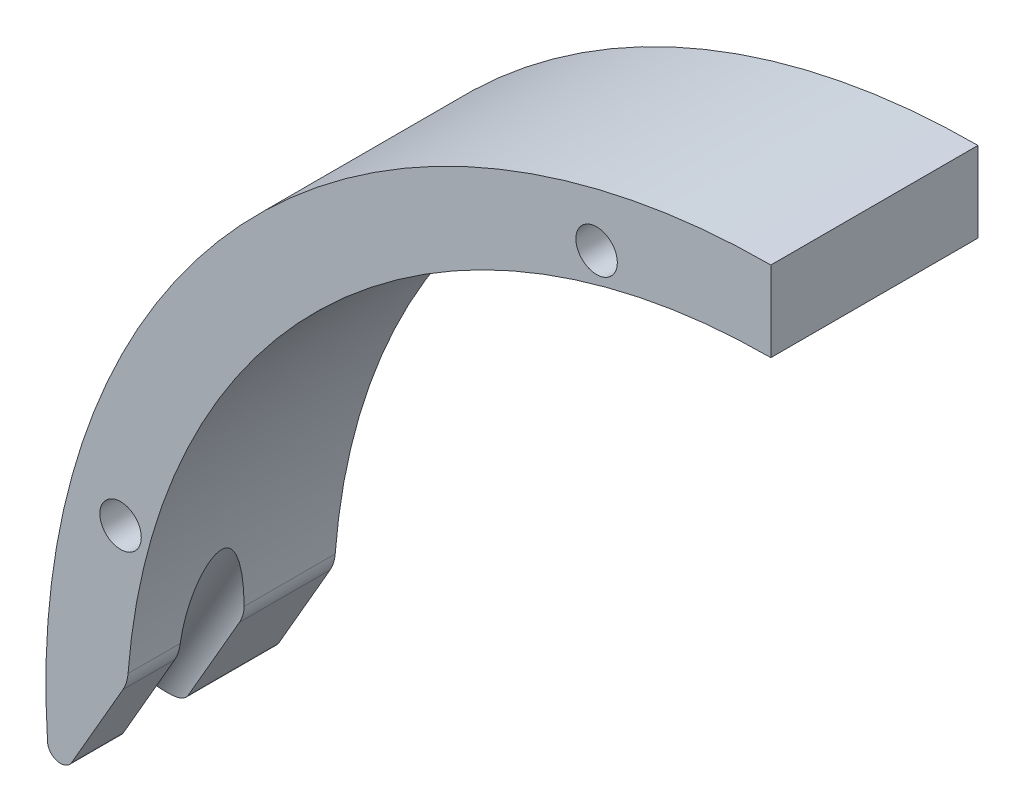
ISO-10303-21;
HEADER;
FILE_DESCRIPTION(('STEP AP214'),'2;1');
FILE_NAME('part.step','',(''),(''),'','','');
FILE_SCHEMA(('AUTOMOTIVE_DESIGN { 1 0 10303 214 1 1 1 1 }'));
ENDSEC;
DATA;
#1=APPLICATION_CONTEXT('core data for automotive mechanical design processes');
#2=APPLICATION_PROTOCOL_DEFINITION('international standard','automotive_design',2000,#1);
#3=PRODUCT_CONTEXT('',#1,'mechanical');
#4=PRODUCT('Part','Part','',(#3));
#5=PRODUCT_RELATED_PRODUCT_CATEGORY('part','',(#4));
#6=PRODUCT_DEFINITION_FORMATION('','',#4);
#7=PRODUCT_DEFINITION_CONTEXT('part definition',#1,'design');
#8=PRODUCT_DEFINITION('design','',#6,#7);
#9=PRODUCT_DEFINITION_SHAPE('','',#8);
#10=(LENGTH_UNIT() NAMED_UNIT(*) SI_UNIT(.MILLI.,.METRE.));
#11=(NAMED_UNIT(*) PLANE_ANGLE_UNIT() SI_UNIT($,.RADIAN.));
#12=(NAMED_UNIT(*) SI_UNIT($,.STERADIAN.) SOLID_ANGLE_UNIT());
#13=UNCERTAINTY_MEASURE_WITH_UNIT(LENGTH_MEASURE(1.E-05),#10,'distance_accuracy_value','');
#14=(GEOMETRIC_REPRESENTATION_CONTEXT(3) GLOBAL_UNCERTAINTY_ASSIGNED_CONTEXT((#13)) GLOBAL_UNIT_ASSIGNED_CONTEXT((#10,
#11,#12)) REPRESENTATION_CONTEXT('',''));
#15=CARTESIAN_POINT('',(0.,0.,0.));
#16=DIRECTION('',(0.,0.,1.));
#17=DIRECTION('',(1.,0.,0.));
#18=AXIS2_PLACEMENT_3D('',#15,#16,#17);
#19=CARTESIAN_POINT('',(0.,0.,16.));
#20=DIRECTION('',(0.,0.,-1.));
#21=DIRECTION('',(-1.00000000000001,0.,0.));
#22=AXIS2_PLACEMENT_3D('',#19,#20,#21);
#23=CYLINDRICAL_SURFACE('',#22,49.8);
#24=CARTESIAN_POINT('',(-49.6986512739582,3.17554114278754,7.00328228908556));
#25=CARTESIAN_POINT('',(-49.6870165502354,3.35766541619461,7.00746458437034));
#26=CARTESIAN_POINT('',(-49.6743825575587,3.53962699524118,7.01549308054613));
#27=CARTESIAN_POINT('',(-49.6471577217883,3.9029287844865,7.03901111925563));
#28=CARTESIAN_POINT('',(-49.6325668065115,4.08426897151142,7.05450093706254));
#29=CARTESIAN_POINT('',(-49.6013811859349,4.44705959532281,7.0928198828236));
#30=CARTESIAN_POINT('',(-49.5847754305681,4.62850465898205,7.11569074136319));
#31=CARTESIAN_POINT('',(-49.5496870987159,4.9901407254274,7.16871741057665));
#32=CARTESIAN_POINT('',(-49.5312045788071,5.17033176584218,7.19887300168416));
#33=CARTESIAN_POINT('',(-49.4924878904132,5.52865556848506,7.26653281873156));
#34=CARTESIAN_POINT('',(-49.4722583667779,5.70679244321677,7.30401787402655));
#35=CARTESIAN_POINT('',(-49.4301076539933,6.06104488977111,7.38676967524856));
#36=CARTESIAN_POINT('',(-49.4081865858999,6.23716060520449,7.43203586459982));
#37=CARTESIAN_POINT('',(-49.3628441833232,6.58639120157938,7.53094623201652));
#38=CARTESIAN_POINT('',(-49.3394264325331,6.75951207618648,7.58457080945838));
#39=CARTESIAN_POINT('',(-49.2912551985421,7.10225696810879,7.70142336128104));
#40=CARTESIAN_POINT('',(-49.2665023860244,7.27188268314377,7.76464654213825));
#41=CARTESIAN_POINT('',(-49.2300446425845,7.51321176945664,7.86430095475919));
#42=CARTESIAN_POINT('',(-49.2187392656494,7.58690882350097,7.8960773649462));
#43=CARTESIAN_POINT('',(-49.1959763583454,7.73313519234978,7.9621875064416));
#44=CARTESIAN_POINT('',(-49.1845188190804,7.80566443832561,7.99652138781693));
#45=CARTESIAN_POINT('',(-49.1614316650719,7.94977981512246,8.06831164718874));
#46=CARTESIAN_POINT('',(-49.1498014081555,8.02135593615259,8.10578800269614));
#47=CARTESIAN_POINT('',(-49.1265327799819,8.16265279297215,8.1840785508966));
#48=CARTESIAN_POINT('',(-49.1148944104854,8.23237384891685,8.22489216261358));
#49=CARTESIAN_POINT('',(-49.0915360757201,8.3705479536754,8.31112794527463));
#50=CARTESIAN_POINT('',(-49.0798179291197,8.43896114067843,8.3566150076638));
#51=CARTESIAN_POINT('',(-49.0566697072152,8.57249953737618,8.45245508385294));
#52=CARTESIAN_POINT('',(-49.0452399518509,8.63762116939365,8.50281322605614));
#53=CARTESIAN_POINT('',(-49.0230862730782,8.76247629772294,8.60885936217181));
#54=CARTESIAN_POINT('',(-49.0123566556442,8.82225527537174,8.66449191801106));
#55=CARTESIAN_POINT('',(-48.99197865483,8.93472252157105,8.78259808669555));
#56=CARTESIAN_POINT('',(-48.982327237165,8.98743077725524,8.84505147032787));
#57=CARTESIAN_POINT('',(-48.9677792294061,9.06629144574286,8.95585069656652));
#58=CARTESIAN_POINT('',(-48.9623693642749,9.09544297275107,9.00197147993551));
#59=CARTESIAN_POINT('',(-48.9527104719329,9.14728546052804,9.09790675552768));
#60=CARTESIAN_POINT('',(-48.9484613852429,9.16997675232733,9.14772105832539));
#61=CARTESIAN_POINT('',(-48.9414848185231,9.20714033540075,9.25119826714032));
#62=CARTESIAN_POINT('',(-48.9387761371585,9.22151112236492,9.30490006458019));
#63=CARTESIAN_POINT('',(-48.9353360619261,9.23974998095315,9.4141075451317));
#64=CARTESIAN_POINT('',(-48.93460158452,9.24363443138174,9.46961027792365));
#65=CARTESIAN_POINT('',(-48.9351838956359,9.2405504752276,9.57405464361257));
#66=CARTESIAN_POINT('',(-48.9362806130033,9.23474644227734,9.62303631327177));
#67=CARTESIAN_POINT('',(-48.9399777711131,9.21513281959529,9.71931457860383));
#68=CARTESIAN_POINT('',(-48.9425797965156,9.20131479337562,9.7666093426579));
#69=CARTESIAN_POINT('',(-48.9501556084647,9.16093965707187,9.87474391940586));
#70=CARTESIAN_POINT('',(-48.9556416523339,9.1316116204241,9.93449892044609));
#71=CARTESIAN_POINT('',(-48.9681757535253,9.06415669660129,10.0486069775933));
#72=CARTESIAN_POINT('',(-48.9752273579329,9.02600982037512,10.1029473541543));
#73=CARTESIAN_POINT('',(-48.9895129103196,8.94812948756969,10.2008473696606));
#74=CARTESIAN_POINT('',(-48.996642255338,8.90902764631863,10.2449358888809));
#75=CARTESIAN_POINT('',(-49.0114454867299,8.82722723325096,10.3295733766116));
#76=CARTESIAN_POINT('',(-49.0191198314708,8.78452562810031,10.3701193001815));
#77=CARTESIAN_POINT('',(-49.0348420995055,8.69633675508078,10.448195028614));
#78=CARTESIAN_POINT('',(-49.0428909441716,8.65084251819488,10.4857166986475));
#79=CARTESIAN_POINT('',(-49.0592109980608,8.55780631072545,10.5580223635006));
#80=CARTESIAN_POINT('',(-49.0674821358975,8.51026499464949,10.592807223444));
#81=CARTESIAN_POINT('',(-49.0878111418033,8.39236376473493,10.6747329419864));
#82=CARTESIAN_POINT('',(-49.0999396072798,8.32113647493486,10.7206060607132));
#83=CARTESIAN_POINT('',(-49.1242828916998,8.17620011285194,10.8082466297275));
#84=CARTESIAN_POINT('',(-49.1364977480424,8.1024899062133,10.8500121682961));
#85=CARTESIAN_POINT('',(-49.1731112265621,7.87832585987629,10.9701853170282));
#86=CARTESIAN_POINT('',(-49.1974439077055,7.72503975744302,11.0433360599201));
#87=CARTESIAN_POINT('',(-49.2454945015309,7.41259149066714,11.1793067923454));
#88=CARTESIAN_POINT('',(-49.2692064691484,7.2533940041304,11.2420455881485));
#89=CARTESIAN_POINT('',(-49.3154924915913,6.93170842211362,11.358402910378));
#90=CARTESIAN_POINT('',(-49.3380674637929,6.76922313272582,11.4120288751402));
#91=CARTESIAN_POINT('',(-49.3788115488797,6.46476096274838,11.504410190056));
#92=CARTESIAN_POINT('',(-49.3971535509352,6.32311661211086,11.5441962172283));
#93=CARTESIAN_POINT('',(-49.4327780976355,6.03829958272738,11.6184273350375));
#94=CARTESIAN_POINT('',(-49.4500605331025,5.89512674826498,11.6528718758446));
#95=CARTESIAN_POINT('',(-49.5002415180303,5.46351086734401,11.7487437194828));
#96=CARTESIAN_POINT('',(-49.5314488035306,5.17315616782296,11.8026540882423));
#97=CARTESIAN_POINT('',(-49.5741006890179,4.74011469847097,11.8685171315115));
#98=CARTESIAN_POINT('',(-49.5874240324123,4.59865807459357,11.8877553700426));
#99=CARTESIAN_POINT('',(-49.6129034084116,4.31509734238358,11.9217805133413));
#100=CARTESIAN_POINT('',(-49.6250594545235,4.17299324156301,11.9365674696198));
#101=CARTESIAN_POINT('',(-49.6481593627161,3.88852185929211,11.9616169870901));
#102=CARTESIAN_POINT('',(-49.6591051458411,3.74615537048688,11.9718867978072));
#103=CARTESIAN_POINT('',(-49.6797888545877,3.46107286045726,11.987803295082));
#104=CARTESIAN_POINT('',(-49.6895267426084,3.31835682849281,11.9934498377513));
#105=CARTESIAN_POINT('',(-49.6986512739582,3.17554114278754,11.9967177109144));
#106=B_SPLINE_CURVE_WITH_KNOTS('',3,(#24,#25,#26,#27,#28,#29,#30,#31,#32,#33,#34,#35,#36,#37,
#38,#39,#40,#41,#42,#43,#44,#45,#46,#47,#48,#49,#50,#51,#52,#53,#54,#55,#56,#57,#58,#59,#60,#61,
#62,#63,#64,#65,#66,#67,#68,#69,#70,#71,#72,#73,#74,#75,#76,#77,#78,#79,#80,#81,#82,#83,#84,#85,
#86,#87,#88,#89,#90,#91,#92,#93,#94,#95,#96,#97,#98,#99,#100,#101,#102,#103,#104,#105),
.UNSPECIFIED.,.F.,.F.,(4,2,2,2,2,2,2,2,2,2,2,2,2,2,2,2,2,2,2,2,2,2,2,2,2,2,2,2,2,2,2,2,2,2,2,2,
2,2,2,2,4),(0.,0.547571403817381,1.09516301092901,1.64590645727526,2.19663330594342,
2.74593851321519,3.29520444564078,3.84320119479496,4.39092517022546,4.63403175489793,
4.87715261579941,5.12195715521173,5.3667191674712,5.61551688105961,5.86457944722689,
6.11126563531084,6.35723911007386,6.5213259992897,6.68540447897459,6.85144457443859,
7.01722517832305,7.16447853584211,7.31188719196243,7.51112885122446,7.71082662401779,
7.8886475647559,8.06661987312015,8.24505594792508,8.42343538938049,8.68000800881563,
8.93669948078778,9.45081087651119,9.96876003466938,10.4862843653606,10.9309637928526,
11.3756889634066,12.2657240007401,12.6958102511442,13.1258915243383,13.5552800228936,
13.9846818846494),.UNSPECIFIED.);
#107=CARTESIAN_POINT('',(-49.6513263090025,3.84523026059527,7.03586135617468));
#108=VERTEX_POINT('',#107);
#109=CARTESIAN_POINT('',(-49.6513263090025,3.84523026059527,11.9641386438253));
#110=VERTEX_POINT('',#109);
#111=EDGE_CURVE('E247',#108,#110,#106,.T.);
#112=ORIENTED_EDGE('',*,*,#111,.F.);
#113=DIRECTION('',(0.,0.,-1.));
#114=VECTOR('',#113,1.);
#115=CARTESIAN_POINT('',(-49.6513263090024,3.84523026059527,16.));
#116=LINE('',#115,#114);
#117=CARTESIAN_POINT('',(-49.6513263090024,3.84523026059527,0.));
#118=VERTEX_POINT('',#117);
#119=EDGE_CURVE('E196',#108,#118,#116,.T.);
#120=ORIENTED_EDGE('',*,*,#119,.T.);
#121=CARTESIAN_POINT('',(0.,0.,0.));
#122=DIRECTION('',(0.,0.,-1.));
#123=DIRECTION('',(-1.00000000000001,0.,0.));
#124=AXIS2_PLACEMENT_3D('',#121,#122,#123);
#125=CIRCLE('',#124,49.8);
#126=CARTESIAN_POINT('',(0.,49.8000000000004,0.));
#127=VERTEX_POINT('',#126);
#128=EDGE_CURVE('E135',#118,#127,#125,.T.);
#129=ORIENTED_EDGE('',*,*,#128,.T.);
#130=DIRECTION('',(0.,0.,-1.));
#131=VECTOR('',#130,1.);
#132=CARTESIAN_POINT('',(0.,49.8000000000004,16.));
#133=LINE('',#132,#131);
#134=CARTESIAN_POINT('',(0.,49.8000000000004,16.));
#135=VERTEX_POINT('',#134);
#136=EDGE_CURVE('E126',#135,#127,#133,.T.);
#137=ORIENTED_EDGE('',*,*,#136,.F.);
#138=CARTESIAN_POINT('',(0.,0.,16.));
#139=DIRECTION('',(0.,0.,-1.));
#140=DIRECTION('',(-1.00000000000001,0.,0.));
#141=AXIS2_PLACEMENT_3D('',#138,#139,#140);
#142=CIRCLE('',#141,49.8);
#143=CARTESIAN_POINT('',(-49.6513263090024,3.84523026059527,16.));
#144=VERTEX_POINT('',#143);
#145=EDGE_CURVE('E110',#144,#135,#142,.T.);
#146=ORIENTED_EDGE('',*,*,#145,.F.);
#147=DIRECTION('',(0.,0.,-1.));
#148=VECTOR('',#147,1.);
#149=CARTESIAN_POINT('',(-49.6513263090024,3.84523026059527,16.));
#150=LINE('',#149,#148);
#151=EDGE_CURVE('E198',#144,#110,#150,.T.);
#152=ORIENTED_EDGE('',*,*,#151,.T.);
#153=EDGE_LOOP('',(#112,#120,#129,#137,#146,#152));
#154=FACE_BOUND('',#153,.T.);
#155=ADVANCED_FACE('F35',(#154),#23,.F.);
#156=CARTESIAN_POINT('',(0.,0.,16.));
#157=DIRECTION('',(0.,0.,-1.));
#158=DIRECTION('',(-1.00000000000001,0.,0.));
#159=AXIS2_PLACEMENT_3D('',#156,#157,#158);
#160=CYLINDRICAL_SURFACE('',#159,56.);
#161=CARTESIAN_POINT('',(0.,0.,0.));
#162=DIRECTION('',(0.,0.,1.));
#163=DIRECTION('',(-1.00000000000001,0.,0.));
#164=AXIS2_PLACEMENT_3D('',#161,#162,#163);
#165=CIRCLE('',#164,56.);
#166=CARTESIAN_POINT('',(0.,56.0000000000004,0.));
#167=VERTEX_POINT('',#166);
#168=CARTESIAN_POINT('',(-55.8674985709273,-3.8500134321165,0.));
#169=VERTEX_POINT('',#168);
#170=EDGE_CURVE('E121',#167,#169,#165,.T.);
#171=ORIENTED_EDGE('',*,*,#170,.T.);
#172=DIRECTION('',(0.,0.,-1.));
#173=VECTOR('',#172,1.);
#174=CARTESIAN_POINT('',(-55.8674985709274,-3.8500134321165,16.));
#175=LINE('',#174,#173);
#176=CARTESIAN_POINT('',(-55.8674985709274,-3.85001343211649,7.94515509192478));
#177=VERTEX_POINT('',#176);
#178=EDGE_CURVE('E152',#169,#177,#175,.F.);
#179=ORIENTED_EDGE('',*,*,#178,.T.);
#180=CARTESIAN_POINT('',(-55.5630545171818,-6.98190323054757,11.9967177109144));
#181=CARTESIAN_POINT('',(-55.5749269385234,-6.88742292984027,11.9937623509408));
#182=CARTESIAN_POINT('',(-55.5865484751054,-6.79298592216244,11.988836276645));
#183=CARTESIAN_POINT('',(-55.6092783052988,-6.60433122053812,11.9750631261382));
#184=CARTESIAN_POINT('',(-55.6203865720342,-6.51011353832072,11.9662158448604));
#185=CARTESIAN_POINT('',(-55.6529715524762,-6.22757750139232,11.9337747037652));
#186=CARTESIAN_POINT('',(-55.6736545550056,-6.03980535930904,11.9042950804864));
#187=CARTESIAN_POINT('',(-55.712997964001,-5.6654773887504,11.8290531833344));
#188=CARTESIAN_POINT('',(-55.7316373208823,-5.47894999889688,11.7831390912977));
#189=CARTESIAN_POINT('',(-55.7665947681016,-5.1108678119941,11.674213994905));
#190=CARTESIAN_POINT('',(-55.7829157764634,-4.92930700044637,11.6112247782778));
#191=CARTESIAN_POINT('',(-55.8050116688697,-4.66984237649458,11.5055770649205));
#192=CARTESIAN_POINT('',(-55.8117183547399,-4.58895780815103,11.4703338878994));
#193=CARTESIAN_POINT('',(-55.8246301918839,-4.42911755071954,11.3956128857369));
#194=CARTESIAN_POINT('',(-55.830835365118,-4.35016177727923,11.3561352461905));
#195=CARTESIAN_POINT('',(-55.8427295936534,-4.19471326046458,11.2726962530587));
#196=CARTESIAN_POINT('',(-55.8484192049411,-4.11821792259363,11.2287398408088));
#197=CARTESIAN_POINT('',(-55.8592778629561,-3.9682161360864,11.1359589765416));
#198=CARTESIAN_POINT('',(-55.8644469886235,-3.89470923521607,11.087135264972));
#199=CARTESIAN_POINT('',(-55.8773668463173,-3.70588761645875,10.9514980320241));
#200=CARTESIAN_POINT('',(-55.8846733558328,-3.59365468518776,10.8602432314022));
#201=CARTESIAN_POINT('',(-55.8977398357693,-3.38431789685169,10.6616324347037));
#202=CARTESIAN_POINT('',(-55.9035036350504,-3.28717683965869,10.5543173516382));
#203=CARTESIAN_POINT('',(-55.9115168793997,-3.14726923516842,10.3643976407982));
#204=CARTESIAN_POINT('',(-55.9142825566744,-3.09756463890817,10.2869629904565));
#205=CARTESIAN_POINT('',(-55.9190321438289,-3.01060392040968,10.125296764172));
#206=CARTESIAN_POINT('',(-55.9210166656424,-2.97333805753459,10.0410705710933));
#207=CARTESIAN_POINT('',(-55.9241335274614,-2.9141383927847,9.8661673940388));
#208=CARTESIAN_POINT('',(-55.9252559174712,-2.89238380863,9.7754279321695));
#209=CARTESIAN_POINT('',(-55.9265348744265,-2.86755513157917,9.59143756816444));
#210=CARTESIAN_POINT('',(-55.9266925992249,-2.86445864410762,9.49818981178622));
#211=CARTESIAN_POINT('',(-55.9260830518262,-2.87632423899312,9.32679371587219));
#212=CARTESIAN_POINT('',(-55.9254489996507,-2.88868586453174,9.24844996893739));
#213=CARTESIAN_POINT('',(-55.9235081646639,-2.92601802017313,9.09484579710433));
#214=CARTESIAN_POINT('',(-55.9222009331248,-2.95099696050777,9.01958746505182));
#215=CARTESIAN_POINT('',(-55.918438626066,-3.02155942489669,8.84980596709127));
#216=CARTESIAN_POINT('',(-55.9157484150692,-3.07120341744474,8.75698711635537));
#217=CARTESIAN_POINT('',(-55.9094039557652,-3.18461765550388,8.58050126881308));
#218=CARTESIAN_POINT('',(-55.9057477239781,-3.24841692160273,8.49685360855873));
#219=CARTESIAN_POINT('',(-55.8952864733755,-3.42467460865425,8.29445570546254));
#220=CARTESIAN_POINT('',(-55.8878625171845,-3.5444281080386,8.18214224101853));
#221=CARTESIAN_POINT('',(-55.871125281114,-3.79918455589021,7.97666041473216));
#222=CARTESIAN_POINT('',(-55.8618071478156,-3.93422627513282,7.88354249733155));
#223=CARTESIAN_POINT('',(-55.8428838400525,-4.19365268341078,7.72625232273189));
#224=CARTESIAN_POINT('',(-55.8335186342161,-4.31672015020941,7.65983923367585));
#225=CARTESIAN_POINT('',(-55.8135194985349,-4.5680351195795,7.53774955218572));
#226=CARTESIAN_POINT('',(-55.8028846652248,-4.69628626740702,7.48208067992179));
#227=CARTESIAN_POINT('',(-55.7803547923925,-4.95672736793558,7.38047672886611));
#228=CARTESIAN_POINT('',(-55.7684574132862,-5.08892429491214,7.33456021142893));
#229=CARTESIAN_POINT('',(-55.7434418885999,-5.35599380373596,7.25193657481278));
#230=CARTESIAN_POINT('',(-55.7303241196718,-5.49086555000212,7.21522662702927));
#231=CARTESIAN_POINT('',(-55.7053327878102,-5.73833558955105,7.15633629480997));
#232=CARTESIAN_POINT('',(-55.6936542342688,-5.85061885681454,7.13273240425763));
#233=CARTESIAN_POINT('',(-55.6694993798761,-6.07615845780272,7.09130664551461));
#234=CARTESIAN_POINT('',(-55.657023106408,-6.18941475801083,7.07348457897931));
#235=CARTESIAN_POINT('',(-55.6313917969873,-6.41569171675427,7.04367449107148));
#236=CARTESIAN_POINT('',(-55.618242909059,-6.52870715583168,7.03164144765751));
#237=CARTESIAN_POINT('',(-55.5912010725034,-6.75510138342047,7.01322223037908));
#238=CARTESIAN_POINT('',(-55.5773081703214,-6.86848014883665,7.00683570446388));
#239=CARTESIAN_POINT('',(-55.5630545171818,-6.98190323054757,7.00328228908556));
#240=B_SPLINE_CURVE_WITH_KNOTS('',3,(#180,#181,#182,#183,#184,#185,#186,#187,#188,#189,#190,
#191,#192,#193,#194,#195,#196,#197,#198,#199,#200,#201,#202,#203,#204,#205,#206,#207,#208,#209,
#210,#211,#212,#213,#214,#215,#216,#217,#218,#219,#220,#221,#222,#223,#224,#225,#226,#227,#228,
#229,#230,#231,#232,#233,#234,#235,#236,#237,#238,#239),.UNSPECIFIED.,.F.,.F.,(4,2,2,2,2,2,2,2,
2,2,2,2,2,2,2,2,2,2,2,2,2,2,2,2,2,2,2,2,2,4),(0.,0.285760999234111,0.571536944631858,
1.1443832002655,1.72266397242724,2.30021030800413,2.5655639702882,2.83090600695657,
3.09595840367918,3.3609705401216,3.79421359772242,4.22637120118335,4.50166313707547,
4.77673898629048,5.05494371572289,5.33281446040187,5.56963142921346,5.80660646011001,
6.12072785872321,6.43549930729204,6.92580049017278,7.4173741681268,7.83727043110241,
8.25746729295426,8.67845687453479,9.09931695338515,9.44515903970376,9.79098926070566,
10.134084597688,10.4771585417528),.UNSPECIFIED.);
#241=CARTESIAN_POINT('',(-55.8674985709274,-3.8500134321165,11.0548449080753));
#242=VERTEX_POINT('',#241);
#243=EDGE_CURVE('E215',#242,#177,#240,.T.);
#244=ORIENTED_EDGE('',*,*,#243,.F.);
#245=DIRECTION('',(0.,0.,-1.));
#246=VECTOR('',#245,1.);
#247=CARTESIAN_POINT('',(-55.8674985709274,-3.8500134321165,16.));
#248=LINE('',#247,#246);
#249=CARTESIAN_POINT('',(-55.8674985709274,-3.8500134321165,16.));
#250=VERTEX_POINT('',#249);
#251=EDGE_CURVE('E149',#242,#250,#248,.F.);
#252=ORIENTED_EDGE('',*,*,#251,.T.);
#253=CARTESIAN_POINT('',(0.,0.,16.));
#254=DIRECTION('',(0.,0.,1.));
#255=DIRECTION('',(-1.00000000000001,0.,0.));
#256=AXIS2_PLACEMENT_3D('',#253,#254,#255);
#257=CIRCLE('',#256,56.);
#258=CARTESIAN_POINT('',(0.,56.0000000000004,16.));
#259=VERTEX_POINT('',#258);
#260=EDGE_CURVE('E130',#259,#250,#257,.T.);
#261=ORIENTED_EDGE('',*,*,#260,.F.);
#262=DIRECTION('',(0.,0.,-1.));
#263=VECTOR('',#262,1.);
#264=CARTESIAN_POINT('',(0.,56.0000000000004,16.));
#265=LINE('',#264,#263);
#266=EDGE_CURVE('E128',#259,#167,#265,.T.);
#267=ORIENTED_EDGE('',*,*,#266,.T.);
#268=EDGE_LOOP('',(#171,#179,#244,#252,#261,#267));
#269=FACE_BOUND('',#268,.T.);
#270=ADVANCED_FACE('F227',(#269),#160,.T.);
#271=CARTESIAN_POINT('',(-48.3220140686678,5.55994672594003,0.));
#272=DIRECTION('',(-0.866025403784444,0.500000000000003,0.));
#273=DIRECTION('',(-0.500000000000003,-0.866025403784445,0.));
#274=AXIS2_PLACEMENT_3D('',#271,#272,#273);
#275=PLANE('',#274);
#276=DIRECTION('',(0.500000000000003,0.866025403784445,0.));
#277=VECTOR('',#276,1.);
#278=CARTESIAN_POINT('',(-38.6490381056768,22.3140325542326,0.));
#279=LINE('',#278,#277);
#280=CARTESIAN_POINT('',(-54.0038392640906,-4.28126319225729,0.));
#281=VERTEX_POINT('',#280);
#282=CARTESIAN_POINT('',(-50.0442938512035,2.57687063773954,0.));
#283=VERTEX_POINT('',#282);
#284=EDGE_CURVE('E137',#281,#283,#279,.T.);
#285=ORIENTED_EDGE('',*,*,#284,.T.);
#286=DIRECTION('',(0.,0.,-1.));
#287=VECTOR('',#286,1.);
#288=CARTESIAN_POINT('',(-50.0442938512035,2.57687063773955,0.));
#289=LINE('',#288,#287);
#290=CARTESIAN_POINT('',(-50.0442938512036,2.57687063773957,7.00328228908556));
#291=VERTEX_POINT('',#290);
#292=EDGE_CURVE('E192',#283,#291,#289,.F.);
#293=ORIENTED_EDGE('',*,*,#292,.T.);
#294=DIRECTION('',(-0.500000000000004,-0.866025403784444,0.));
#295=VECTOR('',#294,1.);
#296=CARTESIAN_POINT('',(-35.6490381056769,27.5101849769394,7.00328228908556));
#297=LINE('',#296,#295);
#298=CARTESIAN_POINT('',(-54.0038392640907,-4.28126319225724,7.00328228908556));
#299=VERTEX_POINT('',#298);
#300=EDGE_CURVE('E146',#299,#291,#297,.F.);
#301=ORIENTED_EDGE('',*,*,#300,.F.);
#302=DIRECTION('',(0.,0.,-1.));
#303=VECTOR('',#302,1.);
#304=CARTESIAN_POINT('',(-54.0038392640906,-4.28126319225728,0.));
#305=LINE('',#304,#303);
#306=EDGE_CURVE('E207',#299,#281,#305,.T.);
#307=ORIENTED_EDGE('',*,*,#306,.T.);
#308=EDGE_LOOP('',(#285,#293,#301,#307));
#309=FACE_BOUND('',#308,.T.);
#310=ADVANCED_FACE('F218',(#309),#275,.F.);
#311=DIRECTION('',(-0.500000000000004,-0.866025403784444,0.));
#312=VECTOR('',#311,1.);
#313=CARTESIAN_POINT('',(-35.6490381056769,27.5101849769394,11.9967177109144));
#314=LINE('',#313,#312);
#315=CARTESIAN_POINT('',(-50.0442938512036,2.57687063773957,11.9967177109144));
#316=VERTEX_POINT('',#315);
#317=CARTESIAN_POINT('',(-54.0038392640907,-4.28126319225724,11.9967177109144));
#318=VERTEX_POINT('',#317);
#319=EDGE_CURVE('E140',#316,#318,#314,.T.);
#320=ORIENTED_EDGE('',*,*,#319,.F.);
#321=DIRECTION('',(0.,0.,-1.));
#322=VECTOR('',#321,1.);
#323=CARTESIAN_POINT('',(-50.0442938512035,2.57687063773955,0.));
#324=LINE('',#323,#322);
#325=CARTESIAN_POINT('',(-50.0442938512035,2.57687063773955,16.));
#326=VERTEX_POINT('',#325);
#327=EDGE_CURVE('E44',#316,#326,#324,.F.);
#328=ORIENTED_EDGE('',*,*,#327,.T.);
#329=DIRECTION('',(-0.500000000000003,-0.866025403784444,0.));
#330=VECTOR('',#329,1.);
#331=CARTESIAN_POINT('',(-48.3220140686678,5.55994672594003,16.));
#332=LINE('',#331,#330);
#333=CARTESIAN_POINT('',(-54.0038392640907,-4.28126319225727,16.));
#334=VERTEX_POINT('',#333);
#335=EDGE_CURVE('E245',#326,#334,#332,.T.);
#336=ORIENTED_EDGE('',*,*,#335,.T.);
#337=DIRECTION('',(0.,0.,-1.));
#338=VECTOR('',#337,1.);
#339=CARTESIAN_POINT('',(-54.0038392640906,-4.28126319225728,0.));
#340=LINE('',#339,#338);
#341=EDGE_CURVE('E200',#334,#318,#340,.T.);
#342=ORIENTED_EDGE('',*,*,#341,.T.);
#343=EDGE_LOOP('',(#320,#328,#336,#342));
#344=FACE_BOUND('',#343,.T.);
#345=ADVANCED_FACE('F260',(#344),#275,.F.);
#346=CARTESIAN_POINT('',(0.,56.0000000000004,16.));
#347=DIRECTION('',(-1.00000000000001,0.,0.));
#348=DIRECTION('',(0.,-1.00000000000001,0.));
#349=AXIS2_PLACEMENT_3D('',#346,#347,#348);
#350=PLANE('',#349);
#351=DIRECTION('',(0.,1.00000000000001,0.));
#352=VECTOR('',#351,1.);
#353=CARTESIAN_POINT('',(0.,56.0000000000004,0.));
#354=LINE('',#353,#352);
#355=EDGE_CURVE('E228',#127,#167,#354,.T.);
#356=ORIENTED_EDGE('',*,*,#355,.T.);
#357=ORIENTED_EDGE('',*,*,#266,.F.);
#358=DIRECTION('',(0.,1.00000000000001,0.));
#359=VECTOR('',#358,1.);
#360=CARTESIAN_POINT('',(0.,56.0000000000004,16.));
#361=LINE('',#360,#359);
#362=EDGE_CURVE('E114',#135,#259,#361,.T.);
#363=ORIENTED_EDGE('',*,*,#362,.F.);
#364=ORIENTED_EDGE('',*,*,#136,.T.);
#365=EDGE_LOOP('',(#356,#357,#363,#364));
#366=FACE_BOUND('',#365,.T.);
#367=ADVANCED_FACE('F125',(#366),#350,.F.);
#368=CARTESIAN_POINT('',(0.,0.,16.));
#369=DIRECTION('',(0.,0.,-1.));
#370=DIRECTION('',(-1.00000000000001,0.,0.));
#371=AXIS2_PLACEMENT_3D('',#368,#369,#370);
#372=PLANE('',#371);
#373=CARTESIAN_POINT('',(-50.228142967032,13.4585903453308,16.));
#374=DIRECTION('',(0.,0.,1.));
#375=DIRECTION('',(1.00000000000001,0.,0.));
#376=AXIS2_PLACEMENT_3D('',#373,#374,#375);
#377=CIRCLE('',#376,1.59999999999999);
#378=CARTESIAN_POINT('',(-48.628142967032,13.4585903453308,16.));
#379=VERTEX_POINT('',#378);
#380=EDGE_CURVE('E242',#379,#379,#377,.T.);
#381=ORIENTED_EDGE('',*,*,#380,.F.);
#382=EDGE_LOOP('',(#381));
#383=FACE_BOUND('',#382,.T.);
#384=CARTESIAN_POINT('',(-13.4585903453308,50.228142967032,16.));
#385=DIRECTION('',(0.,0.,1.));
#386=DIRECTION('',(1.00000000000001,0.,0.));
#387=AXIS2_PLACEMENT_3D('',#384,#385,#386);
#388=CIRCLE('',#387,1.59999999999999);
#389=CARTESIAN_POINT('',(-11.8585903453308,50.228142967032,16.));
#390=VERTEX_POINT('',#389);
#391=EDGE_CURVE('E236',#390,#390,#388,.T.);
#392=ORIENTED_EDGE('',*,*,#391,.F.);
#393=EDGE_LOOP('',(#392));
#394=FACE_BOUND('',#393,.T.);
#395=ORIENTED_EDGE('',*,*,#335,.F.);
#396=CARTESIAN_POINT('',(-52.6423700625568,4.07687063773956,16.));
#397=DIRECTION('',(0.,0.,-1.));
#398=DIRECTION('',(-1.00000000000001,0.,0.));
#399=AXIS2_PLACEMENT_3D('',#396,#397,#398);
#400=CIRCLE('',#399,3.);
#401=EDGE_CURVE('E11',#326,#144,#400,.F.);
#402=ORIENTED_EDGE('',*,*,#401,.T.);
#403=ORIENTED_EDGE('',*,*,#145,.T.);
#404=ORIENTED_EDGE('',*,*,#362,.T.);
#405=ORIENTED_EDGE('',*,*,#260,.T.);
#406=CARTESIAN_POINT('',(-54.8698646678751,-3.78126319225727,16.));
#407=DIRECTION('',(0.,0.,-1.));
#408=DIRECTION('',(-1.00000000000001,0.,0.));
#409=AXIS2_PLACEMENT_3D('',#406,#407,#408);
#410=CIRCLE('',#409,1.);
#411=EDGE_CURVE('E203',#250,#334,#410,.F.);
#412=ORIENTED_EDGE('',*,*,#411,.T.);
#413=EDGE_LOOP('',(#395,#402,#403,#404,#405,#412));
#414=FACE_BOUND('',#413,.T.);
#415=ADVANCED_FACE('F112',(#383,#394,#414),#372,.F.);
#416=CARTESIAN_POINT('',(0.,0.,0.));
#417=DIRECTION('',(0.,0.,-1.));
#418=DIRECTION('',(-1.00000000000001,0.,0.));
#419=AXIS2_PLACEMENT_3D('',#416,#417,#418);
#420=PLANE('',#419);
#421=ORIENTED_EDGE('',*,*,#128,.F.);
#422=CARTESIAN_POINT('',(-52.6423700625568,4.07687063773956,0.));
#423=DIRECTION('',(0.,0.,-1.));
#424=DIRECTION('',(-1.00000000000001,0.,0.));
#425=AXIS2_PLACEMENT_3D('',#422,#423,#424);
#426=CIRCLE('',#425,3.);
#427=EDGE_CURVE('E194',#118,#283,#426,.T.);
#428=ORIENTED_EDGE('',*,*,#427,.T.);
#429=ORIENTED_EDGE('',*,*,#284,.F.);
#430=CARTESIAN_POINT('',(-54.869864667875,-3.78126319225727,0.));
#431=DIRECTION('',(0.,0.,-1.));
#432=DIRECTION('',(-1.00000000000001,0.,0.));
#433=AXIS2_PLACEMENT_3D('',#430,#431,#432);
#434=CIRCLE('',#433,1.);
#435=EDGE_CURVE('E206',#281,#169,#434,.T.);
#436=ORIENTED_EDGE('',*,*,#435,.T.);
#437=ORIENTED_EDGE('',*,*,#170,.F.);
#438=ORIENTED_EDGE('',*,*,#355,.F.);
#439=EDGE_LOOP('',(#421,#428,#429,#436,#437,#438));
#440=FACE_BOUND('',#439,.T.);
#441=CARTESIAN_POINT('',(-50.228142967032,13.4585903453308,0.));
#442=DIRECTION('',(0.,0.,1.));
#443=DIRECTION('',(1.00000000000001,0.,0.));
#444=AXIS2_PLACEMENT_3D('',#441,#442,#443);
#445=CIRCLE('',#444,1.6);
#446=CARTESIAN_POINT('',(-48.628142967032,13.4585903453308,0.));
#447=VERTEX_POINT('',#446);
#448=EDGE_CURVE('E239',#447,#447,#445,.T.);
#449=ORIENTED_EDGE('',*,*,#448,.T.);
#450=EDGE_LOOP('',(#449));
#451=FACE_BOUND('',#450,.T.);
#452=CARTESIAN_POINT('',(-13.4585903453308,50.228142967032,0.));
#453=DIRECTION('',(0.,0.,1.));
#454=DIRECTION('',(1.00000000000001,0.,0.));
#455=AXIS2_PLACEMENT_3D('',#452,#453,#454);
#456=CIRCLE('',#455,1.6);
#457=CARTESIAN_POINT('',(-11.8585903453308,50.228142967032,0.));
#458=VERTEX_POINT('',#457);
#459=EDGE_CURVE('E232',#458,#458,#456,.T.);
#460=ORIENTED_EDGE('',*,*,#459,.T.);
#461=EDGE_LOOP('',(#460));
#462=FACE_BOUND('',#461,.T.);
#463=ADVANCED_FACE('F224',(#440,#451,#462),#420,.T.);
#464=CARTESIAN_POINT('',(-13.4585903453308,50.228142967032,16.));
#465=DIRECTION('',(0.,0.,1.));
#466=DIRECTION('',(1.00000000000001,0.,0.));
#467=AXIS2_PLACEMENT_3D('',#464,#465,#466);
#468=CYLINDRICAL_SURFACE('',#467,1.59999999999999);
#469=ORIENTED_EDGE('',*,*,#459,.F.);
#470=EDGE_LOOP('',(#469));
#471=FACE_BOUND('',#470,.T.);
#472=ORIENTED_EDGE('',*,*,#391,.T.);
#473=EDGE_LOOP('',(#472));
#474=FACE_BOUND('',#473,.T.);
#475=ADVANCED_FACE('F266',(#471,#474),#468,.F.);
#476=CARTESIAN_POINT('',(-50.228142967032,13.4585903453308,16.));
#477=DIRECTION('',(0.,0.,1.));
#478=DIRECTION('',(1.00000000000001,0.,0.));
#479=AXIS2_PLACEMENT_3D('',#476,#477,#478);
#480=CYLINDRICAL_SURFACE('',#479,1.59999999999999);
#481=ORIENTED_EDGE('',*,*,#448,.F.);
#482=EDGE_LOOP('',(#481));
#483=FACE_BOUND('',#482,.T.);
#484=ORIENTED_EDGE('',*,*,#380,.T.);
#485=EDGE_LOOP('',(#484));
#486=FACE_BOUND('',#485,.T.);
#487=ADVANCED_FACE('F272',(#483,#486),#480,.F.);
#488=CARTESIAN_POINT('',(-35.5381304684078,27.4461524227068,9.5));
#489=DIRECTION('',(-0.500000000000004,-0.866025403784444,0.));
#490=DIRECTION('',(0.866025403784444,-0.500000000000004,0.));
#491=AXIS2_PLACEMENT_3D('',#488,#489,#490);
#492=CYLINDRICAL_SURFACE('',#491,2.5);
#493=ORIENTED_EDGE('',*,*,#300,.T.);
#494=CARTESIAN_POINT('',(-50.0442938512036,2.57687063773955,7.00328228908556));
#495=CARTESIAN_POINT('',(-50.0023043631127,2.64957961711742,7.00331365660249));
#496=CARTESIAN_POINT('',(-49.9633828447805,2.72406142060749,7.00346412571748));
#497=CARTESIAN_POINT('',(-49.8918946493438,2.87606760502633,7.00422973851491));
#498=CARTESIAN_POINT('',(-49.859331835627,2.95359380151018,7.00484516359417));
#499=CARTESIAN_POINT('',(-49.8013805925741,3.10961769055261,7.00674962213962));
#500=CARTESIAN_POINT('',(-49.7758689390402,3.18806981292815,7.00802579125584));
#501=CARTESIAN_POINT('',(-49.7314088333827,3.34674318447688,7.01165885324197));
#502=CARTESIAN_POINT('',(-49.7124562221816,3.42696327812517,7.01401505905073));
#503=CARTESIAN_POINT('',(-49.686095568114,3.56340140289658,7.01936511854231));
#504=CARTESIAN_POINT('',(-49.6769305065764,3.61930251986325,7.02193093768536));
#505=CARTESIAN_POINT('',(-49.6617313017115,3.73184743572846,7.02807517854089));
#506=CARTESIAN_POINT('',(-49.6557180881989,3.78849370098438,7.03166013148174));
#507=CARTESIAN_POINT('',(-49.6513263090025,3.84523026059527,7.03586135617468));
#508=B_SPLINE_CURVE_WITH_KNOTS('',3,(#494,#495,#496,#497,#498,#499,#500,#501,#502,#503,#504,
#505,#506,#507),.UNSPECIFIED.,.F.,.F.,(4,2,2,2,2,2,4),(0.,0.25181628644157,0.503785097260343,
0.751023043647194,0.998103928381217,1.16812770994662,1.33926666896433),.UNSPECIFIED.);
#509=EDGE_CURVE('E183',#291,#108,#508,.T.);
#510=ORIENTED_EDGE('',*,*,#509,.T.);
#511=ORIENTED_EDGE('',*,*,#111,.T.);
#512=CARTESIAN_POINT('',(-49.6513263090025,3.84523026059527,11.9641386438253));
#513=CARTESIAN_POINT('',(-49.6577800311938,3.76172579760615,11.9703040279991));
#514=CARTESIAN_POINT('',(-49.6677624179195,3.67841506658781,11.9751627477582));
#515=CARTESIAN_POINT('',(-49.6946839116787,3.5128106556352,11.9829280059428));
#516=CARTESIAN_POINT('',(-49.7116246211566,3.43051721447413,11.9858340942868));
#517=CARTESIAN_POINT('',(-49.7519833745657,3.26911854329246,11.9903113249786));
#518=CARTESIAN_POINT('',(-49.7752761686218,3.18998250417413,11.9919061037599));
#519=CARTESIAN_POINT('',(-49.8282909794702,3.03392105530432,11.9942980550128));
#520=CARTESIAN_POINT('',(-49.8580096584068,2.95699452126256,11.9950956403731));
#521=CARTESIAN_POINT('',(-49.9134284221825,2.82943614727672,11.9960279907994));
#522=CARTESIAN_POINT('',(-49.9374907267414,2.77808667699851,11.9962919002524));
#523=CARTESIAN_POINT('',(-49.988649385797,2.67650546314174,11.9966342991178));
#524=CARTESIAN_POINT('',(-50.0157643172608,2.62628307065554,11.9967115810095));
#525=CARTESIAN_POINT('',(-50.0442938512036,2.57687063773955,11.9967177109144));
#526=B_SPLINE_CURVE_WITH_KNOTS('',3,(#512,#513,#514,#515,#516,#517,#518,#519,#520,#521,#522,
#523,#524,#525),.UNSPECIFIED.,.F.,.F.,(4,2,2,2,2,2,4),(0.,0.251833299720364,0.503724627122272,
0.750969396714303,0.998086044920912,1.16812532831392,1.33926188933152),.UNSPECIFIED.);
#527=EDGE_CURVE('E58',#110,#316,#526,.T.);
#528=ORIENTED_EDGE('',*,*,#527,.T.);
#529=ORIENTED_EDGE('',*,*,#319,.T.);
#530=CARTESIAN_POINT('',(-54.0038392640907,-4.28126319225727,11.9967177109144));
#531=CARTESIAN_POINT('',(-54.0178387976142,-4.30551071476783,11.9967150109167));
#532=CARTESIAN_POINT('',(-54.0328503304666,-4.32915855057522,11.9966576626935));
#533=CARTESIAN_POINT('',(-54.0648011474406,-4.37511224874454,11.996411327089));
#534=CARTESIAN_POINT('',(-54.0817403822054,-4.39741814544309,11.9962223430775));
#535=CARTESIAN_POINT('',(-54.1352676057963,-4.46206396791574,11.9954249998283));
#536=CARTESIAN_POINT('',(-54.174595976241,-4.50218536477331,11.9945863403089));
#537=CARTESIAN_POINT('',(-54.2593937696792,-4.57528132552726,11.9918634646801));
#538=CARTESIAN_POINT('',(-54.3048671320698,-4.60825126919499,11.9899785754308));
#539=CARTESIAN_POINT('',(-54.4006028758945,-4.66608925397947,11.9845014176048));
#540=CARTESIAN_POINT('',(-54.4508634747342,-4.69096029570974,11.9809097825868));
#541=CARTESIAN_POINT('',(-54.5541715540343,-4.73173396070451,11.9712816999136));
#542=CARTESIAN_POINT('',(-54.6071907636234,-4.74771324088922,11.9652669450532));
#543=CARTESIAN_POINT('',(-54.7147002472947,-4.77067897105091,11.9500482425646));
#544=CARTESIAN_POINT('',(-54.769190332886,-4.77766656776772,11.9408447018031));
#545=CARTESIAN_POINT('',(-54.8765095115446,-4.7826486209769,11.9189378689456));
#546=CARTESIAN_POINT('',(-54.9293471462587,-4.7808543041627,11.9063236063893));
#547=CARTESIAN_POINT('',(-55.0330280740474,-4.76924064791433,11.8772420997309));
#548=CARTESIAN_POINT('',(-55.0838714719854,-4.75942173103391,11.8607750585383));
#549=CARTESIAN_POINT('',(-55.1825258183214,-4.73251415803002,11.8238943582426));
#550=CARTESIAN_POINT('',(-55.2303110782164,-4.71537137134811,11.8034519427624));
#551=CARTESIAN_POINT('',(-55.3213893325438,-4.67491401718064,11.7590235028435));
#552=CARTESIAN_POINT('',(-55.364681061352,-4.65159771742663,11.7350364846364));
#553=CARTESIAN_POINT('',(-55.449937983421,-4.59753248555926,11.681641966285));
#554=CARTESIAN_POINT('',(-55.4914042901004,-4.56629362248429,11.6519377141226));
#555=CARTESIAN_POINT('',(-55.5678835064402,-4.4991517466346,11.5896482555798));
#556=CARTESIAN_POINT('',(-55.6028918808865,-4.46324548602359,11.5570610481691));
#557=CARTESIAN_POINT('',(-55.672099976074,-4.38109498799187,11.4837631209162));
#558=CARTESIAN_POINT('',(-55.7050320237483,-4.33415095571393,11.4426427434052));
#559=CARTESIAN_POINT('',(-55.7620269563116,-4.23650850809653,11.3587593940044));
#560=CARTESIAN_POINT('',(-55.7860851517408,-4.18580812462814,11.3159955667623));
#561=CARTESIAN_POINT('',(-55.822718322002,-4.08849117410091,11.2360949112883));
#562=CARTESIAN_POINT('',(-55.8364159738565,-4.04226877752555,11.1989910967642));
#563=CARTESIAN_POINT('',(-55.8519256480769,-3.97136694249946,11.1440853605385));
#564=CARTESIAN_POINT('',(-55.8562542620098,-3.94749614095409,11.1259261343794));
#565=CARTESIAN_POINT('',(-55.8631860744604,-3.89918575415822,11.0900245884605));
#566=CARTESIAN_POINT('',(-55.8657886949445,-3.87474598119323,11.0722824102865));
#567=CARTESIAN_POINT('',(-55.8674985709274,-3.85001343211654,11.0548449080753));
#568=B_SPLINE_CURVE_WITH_KNOTS('',3,(#530,#531,#532,#533,#534,#535,#536,#537,#538,#539,#540,
#541,#542,#543,#544,#545,#546,#547,#548,#549,#550,#551,#552,#553,#554,#555,#556,#557,#558,#559,
#560,#561,#562,#563,#564,#565,#566,#567),.UNSPECIFIED.,.F.,.F.,(4,2,2,2,2,2,2,2,2,2,2,2,2,2,2,2,
2,2,4),(0.,0.0839449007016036,0.167887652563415,0.335590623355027,0.503401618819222,
0.671150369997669,0.837429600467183,1.00368762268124,1.16596666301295,1.32823715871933,
1.49172832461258,1.65526541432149,1.83403042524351,2.01292050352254,2.22384826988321,
2.43488734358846,2.61696983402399,2.70783053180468,2.79872164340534),.UNSPECIFIED.);
#569=EDGE_CURVE('E155',#318,#242,#568,.T.);
#570=ORIENTED_EDGE('',*,*,#569,.T.);
#571=ORIENTED_EDGE('',*,*,#243,.T.);
#572=CARTESIAN_POINT('',(-55.8674985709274,-3.8500134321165,7.94515509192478));
#573=CARTESIAN_POINT('',(-55.8651017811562,-3.88450564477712,7.92081446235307));
#574=CARTESIAN_POINT('',(-55.8609847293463,-3.91844699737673,7.89590181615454));
#575=CARTESIAN_POINT('',(-55.8494325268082,-3.98523787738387,7.84540336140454));
#576=CARTESIAN_POINT('',(-55.8419981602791,-4.01808766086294,7.8198177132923));
#577=CARTESIAN_POINT('',(-55.8238526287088,-4.08300735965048,7.76820498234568));
#578=CARTESIAN_POINT('',(-55.8131130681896,-4.11506780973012,7.74217599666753));
#579=CARTESIAN_POINT('',(-55.7884083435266,-4.1780270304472,7.69025435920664));
#580=CARTESIAN_POINT('',(-55.7744427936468,-4.20892566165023,7.6643617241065));
#581=CARTESIAN_POINT('',(-55.7270141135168,-4.30100781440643,7.58625385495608));
#582=CARTESIAN_POINT('',(-55.6883921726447,-4.36021954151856,7.53470758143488));
#583=CARTESIAN_POINT('',(-55.5974052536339,-4.47103600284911,7.43611675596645));
#584=CARTESIAN_POINT('',(-55.5450958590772,-4.52267021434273,7.38905502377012));
#585=CARTESIAN_POINT('',(-55.4444264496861,-4.60142831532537,7.31457184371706));
#586=CARTESIAN_POINT('',(-55.3994585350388,-4.63128818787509,7.28545355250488));
#587=CARTESIAN_POINT('',(-55.3033612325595,-4.6840806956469,7.23133069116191));
#588=CARTESIAN_POINT('',(-55.2522350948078,-4.70701696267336,7.20632396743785));
#589=CARTESIAN_POINT('',(-55.1446602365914,-4.7444596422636,7.16089329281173));
#590=CARTESIAN_POINT('',(-55.0881821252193,-4.75891594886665,7.14049701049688));
#591=CARTESIAN_POINT('',(-54.9720326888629,-4.77776571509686,7.10471330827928));
#592=CARTESIAN_POINT('',(-54.9123623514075,-4.78216226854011,7.08932434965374));
#593=CARTESIAN_POINT('',(-54.7982025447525,-4.78016018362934,7.06457141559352));
#594=CARTESIAN_POINT('',(-54.7437892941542,-4.77479356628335,7.05475988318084));
#595=CARTESIAN_POINT('',(-54.6361135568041,-4.75509778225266,7.03842771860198));
#596=CARTESIAN_POINT('',(-54.5828508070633,-4.74077068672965,7.03190632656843));
#597=CARTESIAN_POINT('',(-54.4804286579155,-4.70388671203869,7.0215588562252));
#598=CARTESIAN_POINT('',(-54.4312020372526,-4.68153230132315,7.01767272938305));
#599=CARTESIAN_POINT('',(-54.3368902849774,-4.62911350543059,7.01163890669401));
#600=CARTESIAN_POINT('',(-54.2918075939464,-4.59904461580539,7.00949222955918));
#601=CARTESIAN_POINT('',(-54.2060610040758,-4.53121377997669,7.00627614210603));
#602=CARTESIAN_POINT('',(-54.1655273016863,-4.49328625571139,7.00523349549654));
#603=CARTESIAN_POINT('',(-54.0913457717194,-4.41130471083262,7.00382920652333));
#604=CARTESIAN_POINT('',(-54.0576835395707,-4.36726383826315,7.00346612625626));
#605=CARTESIAN_POINT('',(-54.0195773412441,-4.30781093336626,7.00330149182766));
#606=CARTESIAN_POINT('',(-54.0115507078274,-4.29462412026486,7.00328385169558));
#607=CARTESIAN_POINT('',(-54.0038392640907,-4.28126319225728,7.00328228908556));
#608=B_SPLINE_CURVE_WITH_KNOTS('',3,(#572,#573,#574,#575,#576,#577,#578,#579,#580,#581,#582,
#583,#584,#585,#586,#587,#588,#589,#590,#591,#592,#593,#594,#595,#596,#597,#598,#599,#600,#601,
#602,#603,#604,#605,#606,#607),.UNSPECIFIED.,.F.,.F.,(4,2,2,2,2,2,2,2,2,2,2,2,2,2,2,2,2,4),(0.,
0.126775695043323,0.253521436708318,0.381387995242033,0.509269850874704,0.770329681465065,
1.0303453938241,1.21360874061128,1.39677578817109,1.58101449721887,1.76519653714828,
1.93102597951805,2.09681710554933,2.25869061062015,2.42065884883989,2.58646940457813,
2.751928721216,2.79822311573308),.UNSPECIFIED.);
#609=EDGE_CURVE('E162',#177,#299,#608,.T.);
#610=ORIENTED_EDGE('',*,*,#609,.T.);
#611=EDGE_LOOP('',(#493,#510,#511,#528,#529,#570,#571,#610));
#612=FACE_BOUND('',#611,.T.);
#613=ADVANCED_FACE('F168',(#612),#492,.F.);
#614=CARTESIAN_POINT('',(-54.8698646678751,-3.78126319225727,16.));
#615=DIRECTION('',(0.,0.,-1.));
#616=DIRECTION('',(-1.00000000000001,0.,0.));
#617=AXIS2_PLACEMENT_3D('',#614,#615,#616);
#618=CYLINDRICAL_SURFACE('',#617,1.);
#619=ORIENTED_EDGE('',*,*,#435,.F.);
#620=ORIENTED_EDGE('',*,*,#306,.F.);
#621=ORIENTED_EDGE('',*,*,#609,.F.);
#622=ORIENTED_EDGE('',*,*,#178,.F.);
#623=EDGE_LOOP('',(#619,#620,#621,#622));
#624=FACE_BOUND('',#623,.T.);
#625=ADVANCED_FACE('F175',(#624),#618,.T.);
#626=CARTESIAN_POINT('',(-54.8698646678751,-3.78126319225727,16.));
#627=DIRECTION('',(0.,0.,-1.));
#628=DIRECTION('',(-1.00000000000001,0.,0.));
#629=AXIS2_PLACEMENT_3D('',#626,#627,#628);
#630=CYLINDRICAL_SURFACE('',#629,1.);
#631=ORIENTED_EDGE('',*,*,#569,.F.);
#632=ORIENTED_EDGE('',*,*,#341,.F.);
#633=ORIENTED_EDGE('',*,*,#411,.F.);
#634=ORIENTED_EDGE('',*,*,#251,.F.);
#635=EDGE_LOOP('',(#631,#632,#633,#634));
#636=FACE_BOUND('',#635,.T.);
#637=ADVANCED_FACE('F171',(#636),#630,.T.);
#638=CARTESIAN_POINT('',(-52.6423700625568,4.07687063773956,16.));
#639=DIRECTION('',(0.,0.,-1.));
#640=DIRECTION('',(-1.00000000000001,0.,0.));
#641=AXIS2_PLACEMENT_3D('',#638,#639,#640);
#642=CYLINDRICAL_SURFACE('',#641,3.);
#643=ORIENTED_EDGE('',*,*,#509,.F.);
#644=ORIENTED_EDGE('',*,*,#292,.F.);
#645=ORIENTED_EDGE('',*,*,#427,.F.);
#646=ORIENTED_EDGE('',*,*,#119,.F.);
#647=EDGE_LOOP('',(#643,#644,#645,#646));
#648=FACE_BOUND('',#647,.T.);
#649=ADVANCED_FACE('F174',(#648),#642,.T.);
#650=CARTESIAN_POINT('',(-52.6423700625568,4.07687063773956,16.));
#651=DIRECTION('',(0.,0.,-1.));
#652=DIRECTION('',(-1.00000000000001,0.,0.));
#653=AXIS2_PLACEMENT_3D('',#650,#651,#652);
#654=CYLINDRICAL_SURFACE('',#653,3.);
#655=ORIENTED_EDGE('',*,*,#401,.F.);
#656=ORIENTED_EDGE('',*,*,#327,.F.);
#657=ORIENTED_EDGE('',*,*,#527,.F.);
#658=ORIENTED_EDGE('',*,*,#151,.F.);
#659=EDGE_LOOP('',(#655,#656,#657,#658));
#660=FACE_BOUND('',#659,.T.);
#661=ADVANCED_FACE('F37',(#660),#654,.T.);
#662=CLOSED_SHELL('',(#155,#270,#310,#345,#367,#415,#463,#475,#487,#613,#625,#637,#649,#661));
#663=MANIFOLD_SOLID_BREP('B2',#662);
#664=ADVANCED_BREP_SHAPE_REPRESENTATION('',(#18,#663),#14);
#665=SHAPE_DEFINITION_REPRESENTATION(#9,#664);
ENDSEC;
END-ISO-10303-21;
